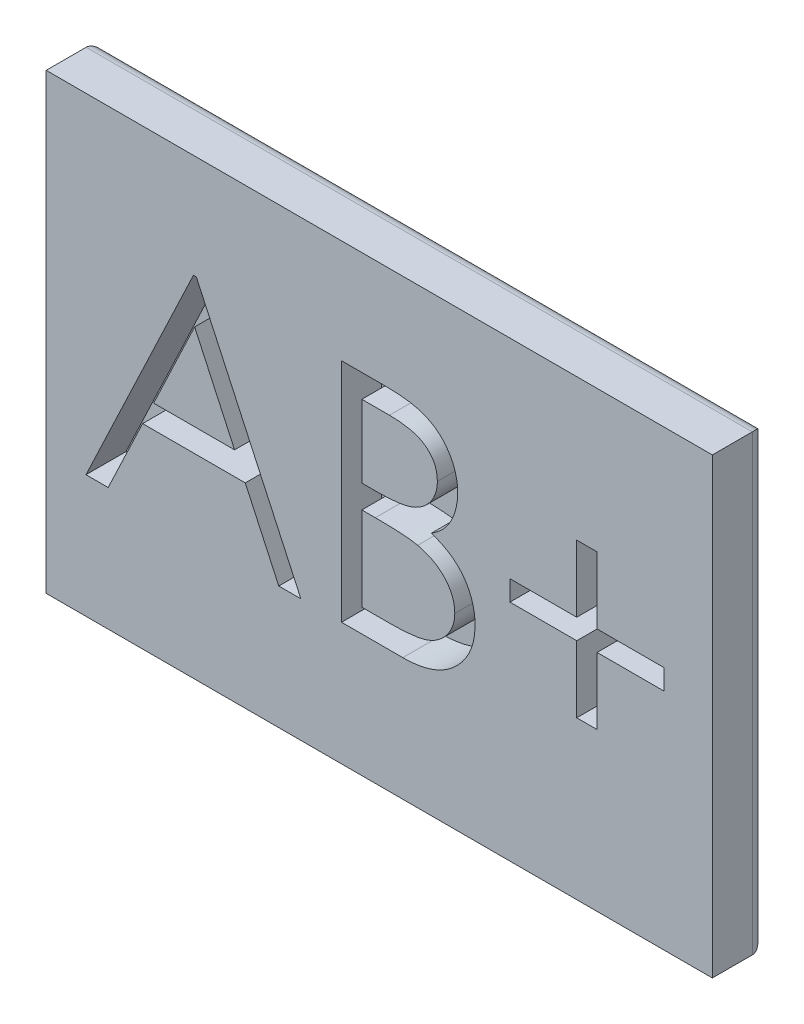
from build123d import *

# Parameters (mm, degrees)
SKETCH1_W           = 31.75
SKETCH1_H           = 21.59
BOSS_EXTRUDE1_DEPTH = 2.54
FILLET1_R           = 0.635
CUT_EXTRUDE1_DEPTH  = 1.905


with BuildPart() as part:
    # Sketch1 → Boss-Extrude1 (new body)
    with BuildSketch(Plane.XY):
        Rectangle(SKETCH1_W, SKETCH1_H)
    extrude(amount=BOSS_EXTRUDE1_DEPTH)

    # Fillet1
    fillet1_edges = [part.edges().sort_by_distance(p)[0] for p in [
        (0, -10.795, 0),
        (-15.875, 0, 0),
        (0, 10.795, 0),
        (15.875, 0, 0),
    ]]
    fillet(fillet1_edges, radius=FILLET1_R)

    # Sketch2 → Cut-Extrude1 (cut)
    # profile 1 of 3: a face of its own
    with BuildSketch(Plane.XY.offset(2.54)):
        Polygon((9.411025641, 0.864205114), (9.411025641, 4.047346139), (10.379807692, 4.047346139), (10.379807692, 0.864205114), (13.562948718, 0.864205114), (13.562948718, -0.104576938), (10.379807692, -0.104576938), (10.379807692, -3.287717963), (9.411025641, -3.287717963), (9.411025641, -0.104576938), (6.227884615, -0.104576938), (6.227884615, 0.864205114), align=None)
    # profile 2 of 3: a face of its own
    with BuildSketch(Plane.XY.offset(2.54)):
        with BuildLine():
            Line((-1.799166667, 5.846512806), (0.307069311, 5.846512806))
            add(Edge.make_bspline(
                [(0.307069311, 5.846512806), (0.410172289, 5.845970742), (0.61001152, 5.844920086), (0.900611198, 5.8286254), (1.172795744, 5.806407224), (1.426644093, 5.771153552), (1.662038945, 5.728615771), (1.879689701, 5.677102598), (2.078904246, 5.6153348), (2.316741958, 5.51711177), (2.587914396, 5.371153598), (2.881533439, 5.155473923), (3.132607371, 4.891667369), (3.349082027, 4.594087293), (3.521188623, 4.266734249), (3.64569907, 3.917410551), (3.72452686, 3.550621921), (3.732633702, 3.298811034), (3.736730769, 3.171549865)],
                knots=[0, 0, 0, 0, 1.001505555, 1.941167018, 2.826882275, 3.653841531, 4.429895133, 5.150066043, 5.825578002, 6.45369114, 7.647487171, 8.808567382, 9.977351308, 11.170798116, 12.373658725, 13.556498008, 14.765093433, 16, 16, 16, 16], degree=3))
            add(Edge.make_bspline(
                [(3.736730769, 3.171549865), (3.733358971, 3.05233434), (3.72673307, 2.81806459), (3.663373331, 2.475418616), (3.564180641, 2.149251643), (3.426296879, 1.840754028), (3.247093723, 1.55689607), (3.034714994, 1.295387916), (2.778482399, 1.067301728), (2.586506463, 0.939788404), (2.488991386, 0.875017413)],
                knots=[0, 0, 0, 0, 1.044552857, 2.05264487, 3.044412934, 4.028983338, 5.005914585, 5.980388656, 6.974128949, 8, 8, 8, 8], degree=3))
            add(Edge.make_bspline(
                [(2.488991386, 0.875017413), (2.611623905, 0.827935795), (2.846250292, 0.737856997), (3.169131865, 0.578598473), (3.447318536, 0.405378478), (3.682949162, 0.216213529), (3.884469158, 0.012315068), (4.060436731, -0.209306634), (4.210583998, -0.451542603), (4.339238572, -0.711867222), (4.439628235, -0.987622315), (4.514810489, -1.276221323), (4.557890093, -1.576629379), (4.564020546, -1.781072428), (4.567115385, -1.884281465)],
                knots=[0, 0, 0, 0, 1.27268992, 2.434971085, 3.483601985, 4.442670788, 5.356604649, 6.2567628, 7.179492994, 8.113709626, 9.066344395, 10.018646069, 10.999752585, 12, 12, 12, 12], degree=3))
            add(Edge.make_bspline(
                [(4.567115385, -1.884281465), (4.564102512, -1.98966186), (4.558174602, -2.197000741), (4.514439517, -2.501589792), (4.440388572, -2.792669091), (4.338387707, -3.072121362), (4.205262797, -3.339405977), (4.043251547, -3.594825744), (3.85007791, -3.835814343), (3.633984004, -4.065049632), (3.389516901, -4.271165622), (3.12576188, -4.454729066), (2.839397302, -4.605692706), (2.535126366, -4.732506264), (2.209535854, -4.829375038), (1.864087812, -4.897144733), (1.499080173, -4.942807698), (1.248606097, -4.946561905), (1.120154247, -4.948487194)],
                knots=[0, 0, 0, 0, 0.978564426, 1.925352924, 2.850884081, 3.763762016, 4.682927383, 5.618979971, 6.567305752, 7.547517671, 8.540179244, 9.531824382, 10.526200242, 11.540722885, 12.589160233, 13.674978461, 14.80764778, 16, 16, 16, 16], degree=3))
            Line((1.120154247, -4.948487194), (-1.799166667, -4.948487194))
            Line((-1.799166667, -4.948487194), (-1.799166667, 5.846512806))
        make_face()
        with BuildLine():
            Line((-0.830384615, 4.739333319), (-0.830384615, 1.279397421))
            Line((-0.830384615, 1.279397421), (-0.179484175, 1.279397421))
            add(Edge.make_bspline(
                [(-0.179484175, 1.279397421), (-0.084337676, 1.280630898), (0.09950475, 1.283014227), (0.365739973, 1.289841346), (0.612868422, 1.308957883), (0.840463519, 1.328068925), (1.048166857, 1.359141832), (1.235518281, 1.396128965), (1.405458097, 1.435246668), (1.601432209, 1.501773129), (1.823725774, 1.600092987), (2.06070102, 1.752678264), (2.269613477, 1.934417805), (2.446025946, 2.144121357), (2.590405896, 2.375030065), (2.690687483, 2.623459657), (2.758687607, 2.883218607), (2.764830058, 3.061546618), (2.767948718, 3.152087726)],
                knots=[0, 0, 0, 0, 1.156816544, 2.235205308, 3.236616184, 4.169592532, 5.011045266, 5.787822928, 6.49130361, 7.128639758, 8.301311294, 9.436451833, 10.541879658, 11.654887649, 12.756523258, 13.837046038, 14.901820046, 16, 16, 16, 16], degree=3))
            add(Edge.make_bspline(
                [(2.767948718, 3.152087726), (2.766325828, 3.212002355), (2.763142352, 3.329531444), (2.737069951, 3.500861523), (2.692756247, 3.661996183), (2.635837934, 3.815143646), (2.55629825, 3.955515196), (2.462648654, 4.087964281), (2.349499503, 4.207980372), (2.22070802, 4.320154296), (2.072635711, 4.419605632), (1.905370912, 4.506708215), (1.716650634, 4.576847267), (1.509655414, 4.638274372), (1.281199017, 4.681418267), (1.033917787, 4.717360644), (0.765786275, 4.735658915), (0.580281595, 4.738081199), (0.484391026, 4.739333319)],
                knots=[0, 0, 0, 0, 0.91205012, 1.789085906, 2.630437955, 3.453916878, 4.269457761, 5.079663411, 5.91843418, 6.774407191, 7.675494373, 8.627863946, 9.638891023, 10.736472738, 11.911756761, 13.175263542, 14.539845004, 16, 16, 16, 16], degree=3))
            Line((0.484391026, 4.739333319), (-0.830384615, 4.739333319))
        make_face(mode=Mode.SUBTRACT)
        with BuildLine():
            Line((-0.830384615, 0.172217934), (-0.830384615, -3.841307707))
            Line((-0.830384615, -3.841307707), (0.549264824, -3.841307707))
            add(Edge.make_bspline(
                [(0.549264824, -3.841307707), (0.648020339, -3.84012412), (0.838358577, -3.837842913), (1.113172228, -3.830395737), (1.367882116, -3.813455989), (1.601325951, -3.786789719), (1.816024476, -3.757863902), (2.009402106, -3.718967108), (2.183026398, -3.674402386), (2.384351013, -3.605517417), (2.611056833, -3.498503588), (2.855365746, -3.337151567), (3.072580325, -3.144928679), (3.257036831, -2.922456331), (3.408206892, -2.68055171), (3.518178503, -2.424107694), (3.586004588, -2.157361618), (3.594215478, -1.975491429), (3.598333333, -1.884281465)],
                knots=[0, 0, 0, 0, 1.160039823, 2.235823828, 3.228722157, 4.157150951, 4.99529583, 5.772374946, 6.472645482, 7.099169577, 8.269452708, 9.405989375, 10.527446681, 11.663510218, 12.788923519, 13.866172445, 14.929861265, 16, 16, 16, 16], degree=3))
            add(Edge.make_bspline(
                [(3.598333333, -1.884281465), (3.597481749, -1.827242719), (3.595792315, -1.714085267), (3.570314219, -1.547793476), (3.533260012, -1.386713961), (3.485356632, -1.23040933), (3.415591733, -1.081705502), (3.334146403, -0.937661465), (3.238652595, -0.798086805), (3.089853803, -0.621627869), (2.873423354, -0.418320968), (2.565899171, -0.219268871), (2.216226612, -0.058738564), (1.96261353, 0.009422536), (1.831603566, 0.044632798)],
                knots=[0, 0, 0, 0, 0.723448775, 1.435228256, 2.130040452, 2.821711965, 3.505591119, 4.210454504, 4.921174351, 5.648778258, 7.137944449, 8.670945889, 10.280296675, 12, 12, 12, 12], degree=3))
            add(Edge.make_bspline(
                [(1.831603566, 0.044632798), (1.779080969, 0.055289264), (1.665201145, 0.078394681), (1.479503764, 0.102784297), (1.267502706, 0.124513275), (1.028708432, 0.140585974), (0.762818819, 0.157199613), (0.469266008, 0.16366064), (0.149248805, 0.171369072), (-0.072796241, 0.171927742), (-0.188134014, 0.172217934)],
                knots=[0, 0, 0, 0, 0.634451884, 1.375622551, 2.216452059, 3.157844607, 4.20941857, 5.370758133, 6.634282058, 8, 8, 8, 8], degree=3))
            Line((-0.188134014, 0.172217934), (-0.830384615, 0.172217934))
        make_face(mode=Mode.SUBTRACT)
    # profile 3 of 3: a face of its own
    with BuildSketch(Plane.XY.offset(2.54)):
        Polygon((-8.719038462, 5.846512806), (-3.736730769, -4.948487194), (-4.789848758, -4.948487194), (-6.385744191, -1.488551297), (-11.279391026, -1.488551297), (-12.920698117, -4.948487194), (-13.978141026, -4.948487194), (-8.857435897, 5.846512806), align=None)
        Polygon((-8.799049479, 3.742439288), (-10.753913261, -0.381371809), (-6.896084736, -0.381371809), align=None, mode=Mode.SUBTRACT)
    extrude(amount=-CUT_EXTRUDE1_DEPTH, mode=Mode.SUBTRACT)


solid = part.part
